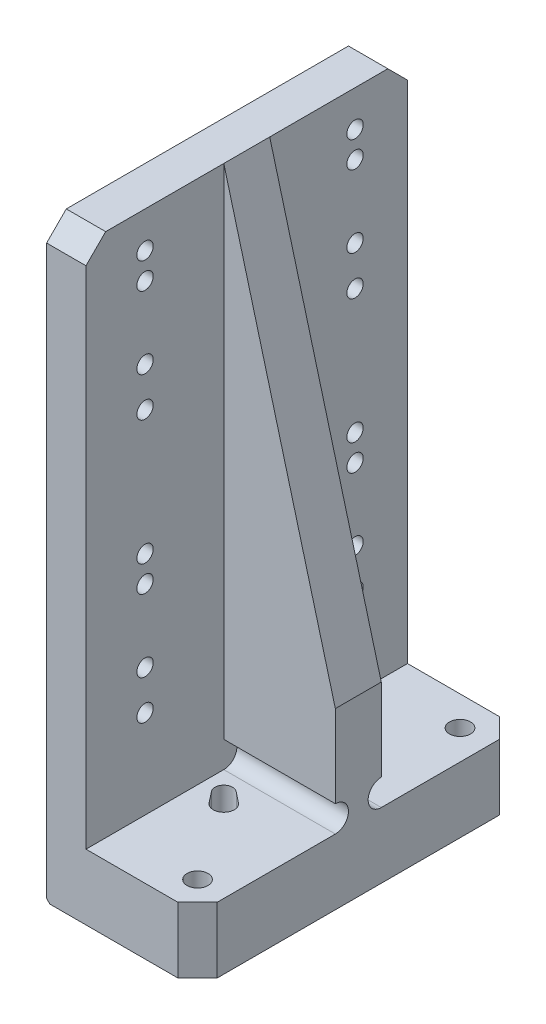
from build123d import *

# Parameters (mm, degrees)
SKETCH1_W                      = 23
SKETCH1_H                      = 49
EXTRUDE1_DEPTH                 = 90
M1_5_1_5_DIAMETER_HOLE1_D      = 1.5
M1_5_1_5_DIAMETER_HOLE1_DEPTH  = 3.5
M1_5_1_5_DIAMETER_HOLE1_TIP    = 0.450645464
M3X0_5_TAPPED_HOLE4_D          = 2.5
F_1_5_1_5_DIAMETER_HOLE1_D     = 1.5
F_1_5_1_5_DIAMETER_HOLE1_DEPTH = 3.5
F_1_5_1_5_DIAMETER_HOLE1_TIP   = 0.450645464
SKETCH9_W                      = 49
SKETCH9_H                      = 80
CUT_EXTRUDE4_DEPTH             = 17
CHAMFER1_SIZE                  = 3
M3_CLEARANCE_HOLE1_D           = 3.2
M2_5_CLEARANCE_HOLE1_D         = 2.7
CUT_EXTRUDE6_START             = -10
CUT_EXTRUDE6_DEPTH             = 10
CHAMFER2_SIZE                  = 0.5
BOSS_EXTRUDE1_DEPTH            = 17
CUT_EXTRUDE7_DEPTH             = 98.020616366


with BuildPart() as part:
    # Sketch1 → Extrude1 (new body)
    with BuildSketch(Plane(origin=(0, 0, 0), x_dir=(1, 0, 0), z_dir=(0, 1, 0))):
        with Locations((11.5, 0)):
            Rectangle(SKETCH1_W, SKETCH1_H)
    extrude(amount=EXTRUDE1_DEPTH)

    # M1.5 _1.5_ Diameter Hole1
    with Locations(Plane.XZ):
        with Locations((2.5, 20), (2.5, -20)):
            Hole(M1_5_1_5_DIAMETER_HOLE1_D / 2, depth=M1_5_1_5_DIAMETER_HOLE1_DEPTH)
            with Locations((0, 0, -(M1_5_1_5_DIAMETER_HOLE1_DEPTH + M1_5_1_5_DIAMETER_HOLE1_TIP / 2))):  # 118° drill point
                Cone(0, M1_5_1_5_DIAMETER_HOLE1_D / 2, M1_5_1_5_DIAMETER_HOLE1_TIP, mode=Mode.SUBTRACT)

    # M3x0.5 Tapped Hole4 (through all)
    with Locations(Plane.ZY):
        with Locations((-16.5, 23.5), (-16.5, 40.5), (-16.5, 63.5), (-16.5, 80.5), (15.5, 23.5), (15.5, 40.5), (15.5, 63.5), (15.5, 80.5), (-16.5, 44.5), (15.5, 44.5), (15.5, 84.5), (-16.5, 84.5), (15.5, 29.5), (-16.5, 29.5), (-16.5, 69.5), (15.5, 69.5)):
            Hole(M3X0_5_TAPPED_HOLE4_D / 2)

    # 1.5 _1.5_ Diameter Hole1
    with Locations(Plane.ZY):
        with Locations((-0.5, 40.5), (-0.5, 80.5), (-0.5, 23.5), (-0.5, 63.5), (-0.5, 84.5), (-0.5, 69.5), (-0.5, 44.5), (-0.49892123, 29.5)):
            Hole(F_1_5_1_5_DIAMETER_HOLE1_D / 2, depth=F_1_5_1_5_DIAMETER_HOLE1_DEPTH)
            with Locations((0, 0, -(F_1_5_1_5_DIAMETER_HOLE1_DEPTH + F_1_5_1_5_DIAMETER_HOLE1_TIP / 2))):  # 118° drill point
                Cone(0, F_1_5_1_5_DIAMETER_HOLE1_D / 2, F_1_5_1_5_DIAMETER_HOLE1_TIP, mode=Mode.SUBTRACT)

    # Sketch9 → Cut-Extrude4 (cut)
    with BuildSketch(Plane(origin=(23, 0, 0), x_dir=(0, 0, -1), z_dir=(1, 0, 0))):
        with Locations((0, 50)):
            Rectangle(SKETCH9_W, SKETCH9_H)
    extrude(amount=-CUT_EXTRUDE4_DEPTH, mode=Mode.SUBTRACT)

    # Chamfer1
    chamfer1_edges = [part.edges().sort_by_distance(p)[0] for p in [
        (3, 90, -24.5),
        (23, 5, -24.5),
        (23, 5, 24.5),
        (3, 90, 24.5),
    ]]
    chamfer(chamfer1_edges, length=CHAMFER1_SIZE)

    # M3 Clearance Hole1 (through all)
    with Locations(Plane.XZ):
        with Locations((18.5, 20), (10.5, 8), (10.5, -8), (18.5, -20)):
            Hole(M3_CLEARANCE_HOLE1_D / 2)

    # M2.5 Clearance Hole1 (through all)
    with Locations(Plane.XZ):
        with Locations((9, 6.5), (9, -6.5)):
            Hole(M2_5_CLEARANCE_HOLE1_D / 2)

    # Sketch15 → Cut-Extrude6 (cut)
    with BuildSketch(Plane.XZ.offset(CUT_EXTRUDE6_START)):
        Polygon((9.36862915, 9.13137085), (8.045405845, 7.454594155), (9.954594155, 5.545405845), (11.63137085, 6.86862915), align=None)
        Polygon((9.954594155, -5.545405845), (11.63137085, -6.86862915), (9.36862915, -9.13137085), (8.045405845, -7.454594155), align=None)
    extrude(amount=CUT_EXTRUDE6_DEPTH, mode=Mode.SUBTRACT)

    # Chamfer2
    chamfer2_edges = [part.edges().sort_by_distance(p)[0] for p in [
        (0, 0, 0),
    ]]
    chamfer(chamfer2_edges, length=CHAMFER2_SIZE)

    # Sketch18 → Boss-Extrude1 (add)
    with BuildSketch(Plane(origin=(6, 0, 0), x_dir=(0, 0, -1), z_dir=(1, 0, 0))):
        with BuildLine():
            Line((-3.5, 90), (3.5, 90))
            Line((3.5, 90), (3.5, 14))
            ThreePointArc((3.5, 14), (1.5, 12), (3.5, 10))
            Line((3.5, 10), (-3.5, 10))
            ThreePointArc((-3.5, 10), (-1.5, 12), (-3.5, 14))
            Line((-3.5, 14), (-3.5, 90))
        make_face()
    extrude(amount=BOSS_EXTRUDE1_DEPTH)

    # Sketch19 → Cut-Extrude7 (cut, through all)
    with BuildSketch(Plane(origin=(0, 0, -3.5), x_dir=(-1, 0, 0), z_dir=(0, 0, -1))):
        Polygon((-6, 90), (-23, 26.555136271), (-23, 90), align=None)
    extrude(amount=-CUT_EXTRUDE7_DEPTH, mode=Mode.SUBTRACT)


solid = part.part
